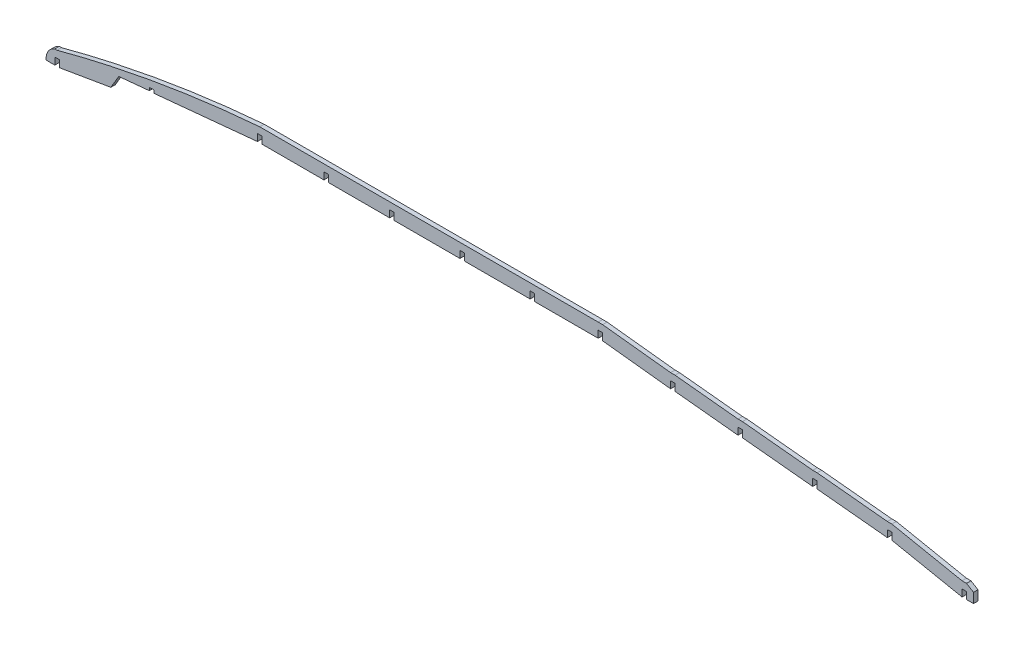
from build123d import *

# Parameters (mm, degrees)
BOSS_EXTRUDE1_DEPTH = 3.175


with BuildPart() as part:
    # Sketch1 → Boss-Extrude1 (new body)
    with BuildSketch(Plane.XY):
        with BuildLine():
            Line((0, 45), (3.175, 45))
            Line((3.175, 45), (3.175, 40))
            Line((3.175, 40), (53.175, 35))
            Line((53.175, 35), (53.175, 40))
            Line((53.175, 40), (56.35, 40))
            Line((56.35, 40), (56.35, 35))
            Line((56.35, 35), (106.35, 30))
            Line((106.35, 30), (106.35, 35))
            Line((106.35, 35), (109.525, 35))
            Line((109.525, 35), (109.525, 30))
            Line((109.525, 30), (159.525, 20))
            Line((159.525, 20), (159.525, 25))
            Line((159.525, 25), (162.7, 25))
            Line((162.7, 25), (162.7, 20))
            Line((162.7, 20), (167.7, 20))
            Line((167.7, 20), (167.7, 27))
            Line((167.7, 27), (162.7, 30))
            Line((162.7, 30), (159.525, 30))
            Line((159.525, 30), (109.525, 40))
            Line((109.525, 40), (106.35, 40))
            Line((106.35, 40), (56.35, 45))
            Line((56.35, 45), (53.175, 45))
            Line((53.175, 45), (3.175, 50))
            Line((3.175, 50), (0, 50))
            Line((0, 50), (-44.81, 54.61197812))
            Line((-44.81, 54.61197812), (-47.985, 54.61197812))
            Line((-47.985, 54.61197812), (-96.395, 60))
            Line((-96.395, 60), (-99.57, 60))
            Line((-99.57, 60), (-340.575, 59.909921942))
            add(Edge.make_bspline(
                [(-484.849858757, 34.963979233), (-413.867924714, 54.013843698), (-340.575, 59.909921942)],
                knots=[0, 0, 0, 1, 1, 1], degree=2))
            Line((-484.849858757, 34.963979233), (-486.437358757, 34.963979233))
            add(Edge.make_bspline(
                [(-492.696470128, 25), (-492.790624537, 32.269203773), (-486.437358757, 34.963979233)],
                knots=[0, 0, 0, 1, 1, 1], degree=2))
            Line((-492.696470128, 25), (-486.437358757, 25))
            Line((-486.437358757, 25), (-486.437358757, 30))
            Line((-486.437358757, 30), (-483.262358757, 30))
            Line((-483.262358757, 30), (-483.262358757, 25))
            Line((-483.262358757, 25), (-446.528110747, 31.257881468))
            Line((-446.528110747, 31.257881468), (-440.893233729, 40.776442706))
            Line((-440.893233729, 40.776442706), (-419.15, 42.875217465))
            Line((-419.15, 42.875217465), (-419.15, 45))
            Line((-419.15, 45), (-415.975, 45))
            Line((-415.975, 45), (-415.975, 42.875217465))
            Line((-415.975, 42.875217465), (-342.1625, 50))
            Line((-342.1625, 50), (-342.1625, 55))
            Line((-342.1625, 55), (-338.9875, 55))
            Line((-338.9875, 55), (-338.9875, 50))
            Line((-338.9875, 50), (-294.8125, 50))
            Line((-294.8125, 50), (-294.8125, 55))
            Line((-294.8125, 55), (-291.6375, 55))
            Line((-291.6375, 55), (-291.6375, 50))
            Line((-291.6375, 50), (-247.9875, 50))
            Line((-247.9875, 50), (-247.9875, 55))
            Line((-247.9875, 55), (-244.8125, 55))
            Line((-244.8125, 55), (-244.8125, 50))
            Line((-244.8125, 50), (-197.9875, 50))
            Line((-197.9875, 50), (-197.9875, 55))
            Line((-197.9875, 55), (-194.8125, 55))
            Line((-194.8125, 55), (-194.8125, 50))
            Line((-194.8125, 50), (-147.9875, 50))
            Line((-147.9875, 50), (-147.9875, 55))
            Line((-147.9875, 55), (-144.8125, 55))
            Line((-144.8125, 55), (-144.8125, 50))
            Line((-144.8125, 50), (-99.575, 50))
            Line((-99.575, 50), (-99.57, 55))
            Line((-99.57, 55), (-96.395, 55))
            Line((-96.395, 55), (-96.395, 50))
            Line((-96.395, 50), (-47.985, 44.61197812))
            Line((-47.985, 44.61197812), (-47.985, 49.61197812))
            Line((-47.985, 49.61197812), (-44.81, 49.61197812))
            Line((-44.81, 49.61197812), (-44.81, 44.61197812))
            Line((-44.81, 44.61197812), (0, 40))
            Line((0, 40), (0, 45))
        make_face()
    extrude(amount=BOSS_EXTRUDE1_DEPTH)


solid = part.part
